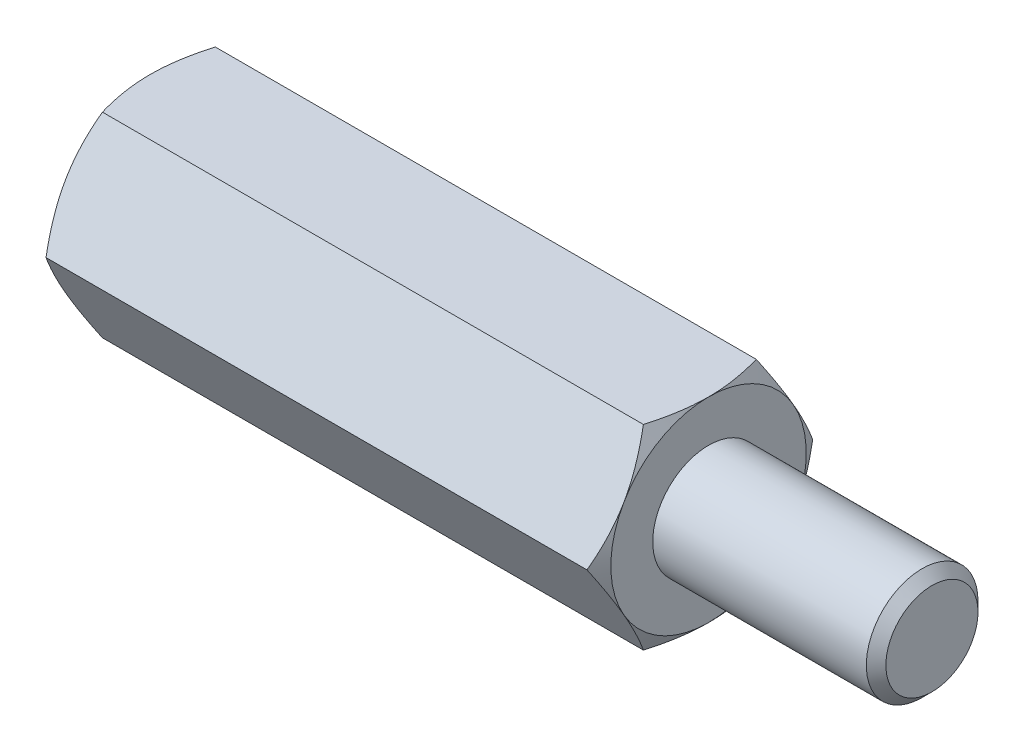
ISO-10303-21;
HEADER;
FILE_DESCRIPTION(('STEP AP214'),'2;1');
FILE_NAME('part.step','',(''),(''),'','','');
FILE_SCHEMA(('AUTOMOTIVE_DESIGN { 1 0 10303 214 1 1 1 1 }'));
ENDSEC;
DATA;
#1=APPLICATION_CONTEXT('core data for automotive mechanical design processes');
#2=APPLICATION_PROTOCOL_DEFINITION('international standard','automotive_design',2000,#1);
#3=PRODUCT_CONTEXT('',#1,'mechanical');
#4=PRODUCT('Part','Part','',(#3));
#5=PRODUCT_RELATED_PRODUCT_CATEGORY('part','',(#4));
#6=PRODUCT_DEFINITION_FORMATION('','',#4);
#7=PRODUCT_DEFINITION_CONTEXT('part definition',#1,'design');
#8=PRODUCT_DEFINITION('design','',#6,#7);
#9=PRODUCT_DEFINITION_SHAPE('','',#8);
#10=(LENGTH_UNIT() NAMED_UNIT(*) SI_UNIT(.MILLI.,.METRE.));
#11=(NAMED_UNIT(*) PLANE_ANGLE_UNIT() SI_UNIT($,.RADIAN.));
#12=(NAMED_UNIT(*) SI_UNIT($,.STERADIAN.) SOLID_ANGLE_UNIT());
#13=UNCERTAINTY_MEASURE_WITH_UNIT(LENGTH_MEASURE(1.E-05),#10,'distance_accuracy_value','');
#14=(GEOMETRIC_REPRESENTATION_CONTEXT(3) GLOBAL_UNCERTAINTY_ASSIGNED_CONTEXT((#13)) GLOBAL_UNIT_ASSIGNED_CONTEXT((#10,
#11,#12)) REPRESENTATION_CONTEXT('',''));
#15=CARTESIAN_POINT('',(0.,0.,0.));
#16=DIRECTION('',(0.,0.,1.));
#17=DIRECTION('',(1.,0.,0.));
#18=AXIS2_PLACEMENT_3D('',#15,#16,#17);
#19=CARTESIAN_POINT('',(10.,3.5,-2.02072594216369));
#20=DIRECTION('',(1.,0.,0.));
#21=DIRECTION('',(0.,0.,-1.));
#22=AXIS2_PLACEMENT_3D('',#19,#20,#21);
#23=PLANE('',#22);
#24=CARTESIAN_POINT('',(10.,0.,0.));
#25=DIRECTION('',(1.,0.,0.));
#26=DIRECTION('',(0.,0.,-1.));
#27=AXIS2_PLACEMENT_3D('',#24,#25,#26);
#28=CIRCLE('',#27,3.5);
#29=CARTESIAN_POINT('',(10.,-1.75,-3.03108891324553));
#30=VERTEX_POINT('',#29);
#31=CARTESIAN_POINT('',(10.,1.75,-3.03108891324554));
#32=VERTEX_POINT('',#31);
#33=EDGE_CURVE('E288',#30,#32,#28,.T.);
#34=ORIENTED_EDGE('',*,*,#33,.T.);
#35=CARTESIAN_POINT('',(10.,3.5,0.));
#36=VERTEX_POINT('',#35);
#37=EDGE_CURVE('E53',#32,#36,#28,.T.);
#38=ORIENTED_EDGE('',*,*,#37,.T.);
#39=CARTESIAN_POINT('',(10.,1.75,3.03108891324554));
#40=VERTEX_POINT('',#39);
#41=EDGE_CURVE('E297',#36,#40,#28,.T.);
#42=ORIENTED_EDGE('',*,*,#41,.T.);
#43=CARTESIAN_POINT('',(10.,-1.75,3.03108891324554));
#44=VERTEX_POINT('',#43);
#45=EDGE_CURVE('E302',#40,#44,#28,.T.);
#46=ORIENTED_EDGE('',*,*,#45,.T.);
#47=CARTESIAN_POINT('',(10.,0.,0.));
#48=DIRECTION('',(-1.,0.,0.));
#49=DIRECTION('',(0.,-1.,0.));
#50=AXIS2_PLACEMENT_3D('',#47,#48,#49);
#51=CIRCLE('',#50,3.5);
#52=CARTESIAN_POINT('',(10.,-3.5,0.));
#53=VERTEX_POINT('',#52);
#54=EDGE_CURVE('E193',#53,#44,#51,.T.);
#55=ORIENTED_EDGE('',*,*,#54,.F.);
#56=EDGE_CURVE('E61',#53,#30,#28,.T.);
#57=ORIENTED_EDGE('',*,*,#56,.T.);
#58=EDGE_LOOP('',(#34,#38,#42,#46,#55,#57));
#59=FACE_BOUND('',#58,.T.);
#60=CARTESIAN_POINT('',(10.,0.,0.));
#61=DIRECTION('',(1.,0.,0.));
#62=DIRECTION('',(0.,0.,-1.));
#63=AXIS2_PLACEMENT_3D('',#60,#61,#62);
#64=CIRCLE('',#63,2.);
#65=CARTESIAN_POINT('',(10.,0.,-2.));
#66=VERTEX_POINT('',#65);
#67=EDGE_CURVE('E347',#66,#66,#64,.T.);
#68=ORIENTED_EDGE('',*,*,#67,.F.);
#69=EDGE_LOOP('',(#68));
#70=FACE_BOUND('',#69,.T.);
#71=ADVANCED_FACE('F37',(#59,#70),#23,.T.);
#72=CARTESIAN_POINT('',(10.,0.,-4.04145188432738));
#73=DIRECTION('',(0.,-0.5,0.866025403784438));
#74=DIRECTION('',(0.,-0.866025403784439,-0.5));
#75=AXIS2_PLACEMENT_3D('',#72,#73,#74);
#76=PLANE('',#75);
#77=CARTESIAN_POINT('',(9.68732593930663,-0.000200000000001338,-4.04156735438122));
#78=CARTESIAN_POINT('',(9.73861421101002,0.153607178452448,-3.9527667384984));
#79=CARTESIAN_POINT('',(9.78525904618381,0.308742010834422,-3.86319960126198));
#80=CARTESIAN_POINT('',(9.86667812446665,0.621698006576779,-3.68251437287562));
#81=CARTESIAN_POINT('',(9.90142356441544,0.779524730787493,-3.59139307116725));
#82=CARTESIAN_POINT('',(9.95550997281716,1.09322221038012,-3.41027974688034));
#83=CARTESIAN_POINT('',(9.97521091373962,1.24904469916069,-3.32031559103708));
#84=CARTESIAN_POINT('',(9.99872986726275,1.56142288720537,-3.13996396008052));
#85=CARTESIAN_POINT('',(10.0025673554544,1.71797745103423,-3.04957714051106));
#86=CARTESIAN_POINT('',(9.99458469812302,2.01050921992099,-2.88068384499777));
#87=CARTESIAN_POINT('',(9.9847245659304,2.1465302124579,-2.80215208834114));
#88=CARTESIAN_POINT('',(9.9534735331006,2.41768602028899,-2.64560020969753));
#89=CARTESIAN_POINT('',(9.93207195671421,2.55281989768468,-2.5675806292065));
#90=CARTESIAN_POINT('',(9.87856959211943,2.82453479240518,-2.41070596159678));
#91=CARTESIAN_POINT('',(9.84624200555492,2.96108141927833,-2.33187072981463));
#92=CARTESIAN_POINT('',(9.77287106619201,3.2321380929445,-2.17537608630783));
#93=CARTESIAN_POINT('',(9.73184495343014,3.36665161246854,-2.09771466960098));
#94=CARTESIAN_POINT('',(9.68732593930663,3.5002,-2.02061047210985));
#95=B_SPLINE_CURVE_WITH_KNOTS('',3,(#77,#78,#79,#80,#81,#82,#83,#84,#85,#86,#87,#88,#89,#90,#91,
#92,#93,#94),.UNSPECIFIED.,.F.,.F.,(4,2,2,2,2,2,2,2,4),(0.,0.554793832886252,1.11092123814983,
1.65328467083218,2.19498204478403,2.6666513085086,3.13875761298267,3.6213361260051,
4.10296698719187),.UNSPECIFIED.);
#96=CARTESIAN_POINT('',(9.68739260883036,0.,-4.04145188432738));
#97=VERTEX_POINT('',#96);
#98=EDGE_CURVE('E316',#97,#32,#95,.T.);
#99=ORIENTED_EDGE('',*,*,#98,.F.);
#100=DIRECTION('',(-1.,0.,0.));
#101=VECTOR('',#100,1.);
#102=CARTESIAN_POINT('',(10.,0.,-4.04145188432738));
#103=LINE('',#102,#101);
#104=CARTESIAN_POINT('',(-9.68739260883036,0.,-4.04145188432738));
#105=VERTEX_POINT('',#104);
#106=EDGE_CURVE('E264',#97,#105,#103,.T.);
#107=ORIENTED_EDGE('',*,*,#106,.T.);
#108=CARTESIAN_POINT('',(-9.68732593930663,3.5002,-2.02061047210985));
#109=CARTESIAN_POINT('',(-9.73861421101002,3.34639282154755,-2.10941108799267));
#110=CARTESIAN_POINT('',(-9.78525904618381,3.19125798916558,-2.19897822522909));
#111=CARTESIAN_POINT('',(-9.86667812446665,2.87830199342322,-2.37966345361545));
#112=CARTESIAN_POINT('',(-9.90142356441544,2.72047526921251,-2.47078475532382));
#113=CARTESIAN_POINT('',(-9.95550997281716,2.40677778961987,-2.65189807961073));
#114=CARTESIAN_POINT('',(-9.97521091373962,2.25095530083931,-2.74186223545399));
#115=CARTESIAN_POINT('',(-9.99872986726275,1.93857711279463,-2.92221386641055));
#116=CARTESIAN_POINT('',(-10.0025673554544,1.78202254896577,-3.01260068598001));
#117=CARTESIAN_POINT('',(-9.99458469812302,1.48949078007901,-3.1814939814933));
#118=CARTESIAN_POINT('',(-9.9847245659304,1.3534697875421,-3.26002573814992));
#119=CARTESIAN_POINT('',(-9.9534735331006,1.08231397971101,-3.41657761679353));
#120=CARTESIAN_POINT('',(-9.93207195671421,0.947180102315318,-3.49459719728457));
#121=CARTESIAN_POINT('',(-9.87856959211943,0.675465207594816,-3.65147186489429));
#122=CARTESIAN_POINT('',(-9.84624200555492,0.538918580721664,-3.73030709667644));
#123=CARTESIAN_POINT('',(-9.77287106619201,0.267861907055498,-3.88680174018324));
#124=CARTESIAN_POINT('',(-9.73184495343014,0.133348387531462,-3.96446315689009));
#125=CARTESIAN_POINT('',(-9.68732593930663,-0.000200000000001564,-4.04156735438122));
#126=B_SPLINE_CURVE_WITH_KNOTS('',3,(#108,#109,#110,#111,#112,#113,#114,#115,#116,#117,#118,
#119,#120,#121,#122,#123,#124,#125),.UNSPECIFIED.,.F.,.F.,(4,2,2,2,2,2,2,2,4),(0.,
0.554793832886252,1.11092123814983,1.65328467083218,2.19498204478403,2.6666513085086,
3.13875761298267,3.6213361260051,4.10296698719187),.UNSPECIFIED.);
#127=CARTESIAN_POINT('',(-10.,1.75,-3.03108891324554));
#128=VERTEX_POINT('',#127);
#129=EDGE_CURVE('E323',#128,#105,#126,.T.);
#130=ORIENTED_EDGE('',*,*,#129,.F.);
#131=CARTESIAN_POINT('',(-9.68739260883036,3.5,-2.02072594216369));
#132=VERTEX_POINT('',#131);
#133=EDGE_CURVE('E326',#132,#128,#126,.T.);
#134=ORIENTED_EDGE('',*,*,#133,.F.);
#135=DIRECTION('',(-1.,0.,0.));
#136=VECTOR('',#135,1.);
#137=CARTESIAN_POINT('',(10.,3.5,-2.02072594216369));
#138=LINE('',#137,#136);
#139=CARTESIAN_POINT('',(9.68739260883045,3.5,-2.02072594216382));
#140=VERTEX_POINT('',#139);
#141=EDGE_CURVE('E279',#140,#132,#138,.T.);
#142=ORIENTED_EDGE('',*,*,#141,.F.);
#143=EDGE_CURVE('E229',#32,#140,#95,.T.);
#144=ORIENTED_EDGE('',*,*,#143,.F.);
#145=EDGE_LOOP('',(#99,#107,#130,#134,#142,#144));
#146=FACE_BOUND('',#145,.T.);
#147=ADVANCED_FACE('F148',(#146),#76,.F.);
#148=CARTESIAN_POINT('',(10.,3.5,-2.02072594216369));
#149=DIRECTION('',(0.,-1.,0.));
#150=DIRECTION('',(0.,0.,-1.));
#151=AXIS2_PLACEMENT_3D('',#148,#149,#150);
#152=PLANE('',#151);
#153=CARTESIAN_POINT('',(8.24432944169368,3.5,-5.525713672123));
#154=CARTESIAN_POINT('',(8.3192813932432,3.5,-5.37200190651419));
#155=CARTESIAN_POINT('',(8.39354243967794,3.5,-5.21794762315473));
#156=CARTESIAN_POINT('',(8.54029601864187,3.5,-4.90897223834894));
#157=CARTESIAN_POINT('',(8.61278829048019,3.5,-4.75405101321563));
#158=CARTESIAN_POINT('',(8.75596172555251,3.5,-4.44240758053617));
#159=CARTESIAN_POINT('',(8.82663168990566,3.5,-4.28568021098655));
#160=CARTESIAN_POINT('',(8.96520746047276,3.5,-3.97101270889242));
#161=CARTESIAN_POINT('',(9.03311339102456,3.5,-3.81307263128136));
#162=CARTESIAN_POINT('',(9.16771439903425,3.5,-3.49026114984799));
#163=CARTESIAN_POINT('',(9.23428710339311,3.5,-3.32533845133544));
#164=CARTESIAN_POINT('',(9.36262677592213,3.5,-2.99359992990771));
#165=CARTESIAN_POINT('',(9.42439321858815,3.5,-2.82678390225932));
#166=CARTESIAN_POINT('',(9.54157006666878,3.5,-2.49127529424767));
#167=CARTESIAN_POINT('',(9.59699254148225,3.5,-2.32258697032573));
#168=CARTESIAN_POINT('',(9.69976794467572,3.5,-1.98279215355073));
#169=CARTESIAN_POINT('',(9.74712331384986,3.5,-1.81168640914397));
#170=CARTESIAN_POINT('',(9.83129873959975,3.5,-1.46793354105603));
#171=CARTESIAN_POINT('',(9.86817965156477,3.5,-1.2953015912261));
#172=CARTESIAN_POINT('',(9.92939557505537,3.5,-0.947791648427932));
#173=CARTESIAN_POINT('',(9.95373192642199,3.5,-0.772913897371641));
#174=CARTESIAN_POINT('',(9.98760388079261,3.5,-0.424108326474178));
#175=CARTESIAN_POINT('',(9.99733725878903,3.5,-0.250200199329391));
#176=CARTESIAN_POINT('',(10.0017053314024,3.5,0.0978233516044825));
#177=CARTESIAN_POINT('',(9.99633996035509,3.5,0.271938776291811));
#178=CARTESIAN_POINT('',(9.97501181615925,3.5,0.564711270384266));
#179=CARTESIAN_POINT('',(9.96289198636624,3.5,0.683667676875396));
#180=CARTESIAN_POINT('',(9.93230809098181,3.5,0.920767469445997));
#181=CARTESIAN_POINT('',(9.91384324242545,3.5,1.03891075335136));
#182=CARTESIAN_POINT('',(9.84989562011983,3.5,1.39193174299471));
#183=CARTESIAN_POINT('',(9.79586958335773,3.5,1.62528232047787));
#184=CARTESIAN_POINT('',(9.70145152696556,3.5,1.97433825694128));
#185=CARTESIAN_POINT('',(9.66729009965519,3.5,2.09183268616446));
#186=CARTESIAN_POINT('',(9.59523444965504,3.5,2.32568238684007));
#187=CARTESIAN_POINT('',(9.55734019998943,3.5,2.44203765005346));
#188=CARTESIAN_POINT('',(9.47844216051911,3.5,2.67364238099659));
#189=CARTESIAN_POINT('',(9.43743925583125,3.5,2.78889215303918));
#190=CARTESIAN_POINT('',(9.35282457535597,3.5,3.01842460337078));
#191=CARTESIAN_POINT('',(9.3092128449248,3.5,3.13270729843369));
#192=CARTESIAN_POINT('',(9.19582414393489,3.5,3.42150510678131));
#193=CARTESIAN_POINT('',(9.12456360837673,3.5,3.59543696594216));
#194=CARTESIAN_POINT('',(8.97810267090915,3.5,3.94163961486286));
#195=CARTESIAN_POINT('',(8.90290192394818,3.5,4.11391025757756));
#196=CARTESIAN_POINT('',(8.74942525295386,3.5,4.45713072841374));
#197=CARTESIAN_POINT('',(8.67114846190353,3.5,4.62808016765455));
#198=CARTESIAN_POINT('',(8.51218826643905,3.5,4.9688584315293));
#199=CARTESIAN_POINT('',(8.43150479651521,3.5,5.13868722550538));
#200=CARTESIAN_POINT('',(8.18638713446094,3.5,5.64726192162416));
#201=CARTESIAN_POINT('',(8.0190975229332,3.5,5.98463020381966));
#202=CARTESIAN_POINT('',(7.67958549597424,3.5,6.65678495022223));
#203=CARTESIAN_POINT('',(7.5073639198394,3.5,6.99157184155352));
#204=CARTESIAN_POINT('',(7.17608002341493,3.5,7.62749570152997));
#205=CARTESIAN_POINT('',(7.01732992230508,3.5,7.92879562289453));
#206=CARTESIAN_POINT('',(6.69774734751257,3.5,8.53030635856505));
#207=CARTESIAN_POINT('',(6.53691477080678,3.5,8.83051711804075));
#208=CARTESIAN_POINT('',(6.21417926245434,3.5,9.42918006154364));
#209=CARTESIAN_POINT('',(6.0522810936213,3.5,9.72763481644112));
#210=CARTESIAN_POINT('',(5.7272737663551,3.5,10.3238577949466));
#211=CARTESIAN_POINT('',(5.56416469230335,3.5,10.6216260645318));
#212=CARTESIAN_POINT('',(5.40061041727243,3.5,10.9191478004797));
#213=B_SPLINE_CURVE_WITH_KNOTS('',3,(#153,#154,#155,#156,#157,#158,#159,#160,#161,#162,#163,
#164,#165,#166,#167,#168,#169,#170,#171,#172,#173,#174,#175,#176,#177,#178,#179,#180,#181,#182,
#183,#184,#185,#186,#187,#188,#189,#190,#191,#192,#193,#194,#195,#196,#197,#198,#199,#200,#201,
#202,#203,#204,#205,#206,#207,#208,#209,#210,#211,#212),.UNSPECIFIED.,.F.,.F.,(4,2,2,2,2,2,2,2,
2,2,2,2,2,2,2,2,2,2,2,2,2,2,2,2,2,2,2,2,2,4),(0.,0.513041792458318,1.02615874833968,
1.54190801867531,2.05763406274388,2.59113284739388,3.1246898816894,3.65721433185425,
4.18957737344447,4.71878103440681,5.24792816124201,5.76984197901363,6.29175806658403,
6.65030258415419,7.0088913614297,7.72642330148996,8.09346920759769,8.46051776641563,
8.8274622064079,9.19440026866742,9.75822236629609,10.3220939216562,10.8861255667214,
11.4501725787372,12.579801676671,13.7092396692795,14.730918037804,15.7526471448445,
16.771258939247,17.7898004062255),.UNSPECIFIED.);
#214=EDGE_CURVE('E227',#140,#36,#213,.T.);
#215=ORIENTED_EDGE('',*,*,#214,.F.);
#216=ORIENTED_EDGE('',*,*,#141,.T.);
#217=CARTESIAN_POINT('',(-8.24432944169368,3.5,-5.52571367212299));
#218=CARTESIAN_POINT('',(-8.3192813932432,3.5,-5.37200190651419));
#219=CARTESIAN_POINT('',(-8.39354243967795,3.5,-5.21794762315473));
#220=CARTESIAN_POINT('',(-8.54029601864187,3.5,-4.90897223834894));
#221=CARTESIAN_POINT('',(-8.61278829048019,3.5,-4.75405101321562));
#222=CARTESIAN_POINT('',(-8.75596172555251,3.5,-4.44240758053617));
#223=CARTESIAN_POINT('',(-8.82663168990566,3.5,-4.28568021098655));
#224=CARTESIAN_POINT('',(-8.96520746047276,3.5,-3.97101270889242));
#225=CARTESIAN_POINT('',(-9.03311339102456,3.5,-3.81307263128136));
#226=CARTESIAN_POINT('',(-9.16771439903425,3.5,-3.49026114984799));
#227=CARTESIAN_POINT('',(-9.23428710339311,3.5,-3.32533845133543));
#228=CARTESIAN_POINT('',(-9.36262677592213,3.5,-2.99359992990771));
#229=CARTESIAN_POINT('',(-9.42439321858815,3.5,-2.82678390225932));
#230=CARTESIAN_POINT('',(-9.54157006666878,3.5,-2.49127529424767));
#231=CARTESIAN_POINT('',(-9.59699254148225,3.5,-2.32258697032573));
#232=CARTESIAN_POINT('',(-9.69976794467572,3.5,-1.98279215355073));
#233=CARTESIAN_POINT('',(-9.74712331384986,3.5,-1.81168640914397));
#234=CARTESIAN_POINT('',(-9.83129873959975,3.5,-1.46793354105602));
#235=CARTESIAN_POINT('',(-9.86817965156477,3.5,-1.2953015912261));
#236=CARTESIAN_POINT('',(-9.92939557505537,3.5,-0.94779164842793));
#237=CARTESIAN_POINT('',(-9.953731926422,3.5,-0.772913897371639));
#238=CARTESIAN_POINT('',(-9.98760388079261,3.5,-0.424108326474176));
#239=CARTESIAN_POINT('',(-9.99733725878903,3.5,-0.250200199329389));
#240=CARTESIAN_POINT('',(-10.0017053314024,3.5,0.0978233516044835));
#241=CARTESIAN_POINT('',(-9.99633996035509,3.5,0.271938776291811));
#242=CARTESIAN_POINT('',(-9.97501181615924,3.5,0.564711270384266));
#243=CARTESIAN_POINT('',(-9.96289198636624,3.5,0.683667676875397));
#244=CARTESIAN_POINT('',(-9.93230809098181,3.5,0.920767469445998));
#245=CARTESIAN_POINT('',(-9.91384324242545,3.5,1.03891075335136));
#246=CARTESIAN_POINT('',(-9.84989562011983,3.5,1.39193174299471));
#247=CARTESIAN_POINT('',(-9.79586958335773,3.5,1.62528232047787));
#248=CARTESIAN_POINT('',(-9.70145152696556,3.5,1.97433825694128));
#249=CARTESIAN_POINT('',(-9.66729009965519,3.5,2.09183268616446));
#250=CARTESIAN_POINT('',(-9.59523444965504,3.5,2.32568238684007));
#251=CARTESIAN_POINT('',(-9.55734019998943,3.5,2.44203765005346));
#252=CARTESIAN_POINT('',(-9.47844216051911,3.5,2.67364238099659));
#253=CARTESIAN_POINT('',(-9.43743925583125,3.5,2.78889215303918));
#254=CARTESIAN_POINT('',(-9.35282457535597,3.5,3.01842460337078));
#255=CARTESIAN_POINT('',(-9.3092128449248,3.5,3.13270729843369));
#256=CARTESIAN_POINT('',(-9.19582414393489,3.5,3.42150510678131));
#257=CARTESIAN_POINT('',(-9.12456360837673,3.5,3.59543696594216));
#258=CARTESIAN_POINT('',(-8.97810267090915,3.5,3.94163961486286));
#259=CARTESIAN_POINT('',(-8.90290192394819,3.5,4.11391025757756));
#260=CARTESIAN_POINT('',(-8.74942525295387,3.5,4.45713072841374));
#261=CARTESIAN_POINT('',(-8.67114846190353,3.5,4.62808016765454));
#262=CARTESIAN_POINT('',(-8.51218826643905,3.5,4.96885843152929));
#263=CARTESIAN_POINT('',(-8.43150479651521,3.5,5.13868722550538));
#264=CARTESIAN_POINT('',(-8.18638713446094,3.5,5.64726192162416));
#265=CARTESIAN_POINT('',(-8.01909752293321,3.5,5.98463020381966));
#266=CARTESIAN_POINT('',(-7.67958549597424,3.5,6.65678495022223));
#267=CARTESIAN_POINT('',(-7.5073639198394,3.5,6.99157184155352));
#268=CARTESIAN_POINT('',(-7.17608002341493,3.5,7.62749570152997));
#269=CARTESIAN_POINT('',(-7.01732992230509,3.5,7.92879562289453));
#270=CARTESIAN_POINT('',(-6.69774734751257,3.5,8.53030635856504));
#271=CARTESIAN_POINT('',(-6.53691477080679,3.5,8.83051711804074));
#272=CARTESIAN_POINT('',(-6.21417926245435,3.5,9.42918006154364));
#273=CARTESIAN_POINT('',(-6.0522810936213,3.5,9.72763481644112));
#274=CARTESIAN_POINT('',(-5.7272737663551,3.5,10.3238577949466));
#275=CARTESIAN_POINT('',(-5.56416469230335,3.5,10.6216260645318));
#276=CARTESIAN_POINT('',(-5.40061041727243,3.5,10.9191478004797));
#277=B_SPLINE_CURVE_WITH_KNOTS('',3,(#217,#218,#219,#220,#221,#222,#223,#224,#225,#226,#227,
#228,#229,#230,#231,#232,#233,#234,#235,#236,#237,#238,#239,#240,#241,#242,#243,#244,#245,#246,
#247,#248,#249,#250,#251,#252,#253,#254,#255,#256,#257,#258,#259,#260,#261,#262,#263,#264,#265,
#266,#267,#268,#269,#270,#271,#272,#273,#274,#275,#276),.UNSPECIFIED.,.F.,.F.,(4,2,2,2,2,2,2,2,
2,2,2,2,2,2,2,2,2,2,2,2,2,2,2,2,2,2,2,2,2,4),(0.,0.513041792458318,1.02615874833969,
1.54190801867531,2.05763406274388,2.59113284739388,3.1246898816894,3.65721433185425,
4.18957737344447,4.71878103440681,5.24792816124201,5.76984197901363,6.29175806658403,
6.65030258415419,7.0088913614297,7.72642330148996,8.09346920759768,8.46051776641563,
8.8274622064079,9.19440026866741,9.75822236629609,10.3220939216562,10.8861255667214,
11.4501725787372,12.579801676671,13.7092396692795,14.730918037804,15.7526471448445,
16.7712589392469,17.7898004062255),.UNSPECIFIED.);
#278=CARTESIAN_POINT('',(-10.,3.5,0.));
#279=VERTEX_POINT('',#278);
#280=EDGE_CURVE('E241',#279,#132,#277,.F.);
#281=ORIENTED_EDGE('',*,*,#280,.F.);
#282=CARTESIAN_POINT('',(-9.68739260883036,3.5,2.02072594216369));
#283=VERTEX_POINT('',#282);
#284=EDGE_CURVE('E249',#283,#279,#277,.F.);
#285=ORIENTED_EDGE('',*,*,#284,.F.);
#286=DIRECTION('',(-1.,0.,0.));
#287=VECTOR('',#286,1.);
#288=CARTESIAN_POINT('',(10.,3.5,2.02072594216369));
#289=LINE('',#288,#287);
#290=CARTESIAN_POINT('',(9.68739260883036,3.5,2.02072594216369));
#291=VERTEX_POINT('',#290);
#292=EDGE_CURVE('E276',#291,#283,#289,.T.);
#293=ORIENTED_EDGE('',*,*,#292,.F.);
#294=EDGE_CURVE('E221',#36,#291,#213,.T.);
#295=ORIENTED_EDGE('',*,*,#294,.F.);
#296=EDGE_LOOP('',(#215,#216,#281,#285,#293,#295));
#297=FACE_BOUND('',#296,.T.);
#298=ADVANCED_FACE('F153',(#297),#152,.F.);
#299=CARTESIAN_POINT('',(10.,3.5,2.02072594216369));
#300=DIRECTION('',(0.,-0.5,-0.866025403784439));
#301=DIRECTION('',(0.,0.866025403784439,-0.5));
#302=AXIS2_PLACEMENT_3D('',#299,#300,#301);
#303=PLANE('',#302);
#304=CARTESIAN_POINT('',(9.68732593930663,3.5002,2.02061047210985));
#305=CARTESIAN_POINT('',(9.73861421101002,3.34639282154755,2.10941108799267));
#306=CARTESIAN_POINT('',(9.78525904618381,3.19125798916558,2.19897822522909));
#307=CARTESIAN_POINT('',(9.86667812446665,2.87830199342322,2.37966345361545));
#308=CARTESIAN_POINT('',(9.90142356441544,2.7204752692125,2.47078475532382));
#309=CARTESIAN_POINT('',(9.95550997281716,2.40677778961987,2.65189807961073));
#310=CARTESIAN_POINT('',(9.97521091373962,2.25095530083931,2.74186223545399));
#311=CARTESIAN_POINT('',(9.99872986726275,1.93857711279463,2.92221386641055));
#312=CARTESIAN_POINT('',(10.0025673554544,1.78202254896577,3.01260068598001));
#313=CARTESIAN_POINT('',(9.99458469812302,1.48949078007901,3.1814939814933));
#314=CARTESIAN_POINT('',(9.98472456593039,1.35346978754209,3.26002573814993));
#315=CARTESIAN_POINT('',(9.9534735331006,1.08231397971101,3.41657761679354));
#316=CARTESIAN_POINT('',(9.9320719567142,0.947180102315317,3.49459719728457));
#317=CARTESIAN_POINT('',(9.87856959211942,0.675465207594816,3.65147186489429));
#318=CARTESIAN_POINT('',(9.84624200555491,0.538918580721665,3.73030709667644));
#319=CARTESIAN_POINT('',(9.77287106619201,0.267861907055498,3.88680174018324));
#320=CARTESIAN_POINT('',(9.73184495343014,0.133348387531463,3.96446315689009));
#321=CARTESIAN_POINT('',(9.68732593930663,-0.000200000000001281,4.04156735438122));
#322=B_SPLINE_CURVE_WITH_KNOTS('',3,(#304,#305,#306,#307,#308,#309,#310,#311,#312,#313,#314,
#315,#316,#317,#318,#319,#320,#321),.UNSPECIFIED.,.F.,.F.,(4,2,2,2,2,2,2,2,4),(0.,
0.554793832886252,1.11092123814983,1.65328467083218,2.19498204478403,2.6666513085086,
3.13875761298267,3.62133612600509,4.10296698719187),.UNSPECIFIED.);
#323=EDGE_CURVE('E228',#291,#40,#322,.T.);
#324=ORIENTED_EDGE('',*,*,#323,.F.);
#325=ORIENTED_EDGE('',*,*,#292,.T.);
#326=CARTESIAN_POINT('',(-9.68732593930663,-0.000200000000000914,4.04156735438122));
#327=CARTESIAN_POINT('',(-9.73861421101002,0.153607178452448,3.9527667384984));
#328=CARTESIAN_POINT('',(-9.78525904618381,0.308742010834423,3.86319960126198));
#329=CARTESIAN_POINT('',(-9.86667812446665,0.62169800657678,3.68251437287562));
#330=CARTESIAN_POINT('',(-9.90142356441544,0.779524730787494,3.59139307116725));
#331=CARTESIAN_POINT('',(-9.95550997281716,1.09322221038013,3.41027974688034));
#332=CARTESIAN_POINT('',(-9.97521091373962,1.24904469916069,3.32031559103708));
#333=CARTESIAN_POINT('',(-9.99872986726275,1.56142288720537,3.13996396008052));
#334=CARTESIAN_POINT('',(-10.0025673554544,1.71797745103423,3.04957714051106));
#335=CARTESIAN_POINT('',(-9.99458469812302,2.01050921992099,2.88068384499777));
#336=CARTESIAN_POINT('',(-9.98472456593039,2.1465302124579,2.80215208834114));
#337=CARTESIAN_POINT('',(-9.9534735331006,2.41768602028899,2.64560020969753));
#338=CARTESIAN_POINT('',(-9.9320719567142,2.55281989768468,2.5675806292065));
#339=CARTESIAN_POINT('',(-9.87856959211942,2.82453479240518,2.41070596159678));
#340=CARTESIAN_POINT('',(-9.84624200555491,2.96108141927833,2.33187072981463));
#341=CARTESIAN_POINT('',(-9.77287106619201,3.2321380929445,2.17537608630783));
#342=CARTESIAN_POINT('',(-9.73184495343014,3.36665161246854,2.09771466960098));
#343=CARTESIAN_POINT('',(-9.68732593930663,3.5002,2.02061047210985));
#344=B_SPLINE_CURVE_WITH_KNOTS('',3,(#326,#327,#328,#329,#330,#331,#332,#333,#334,#335,#336,
#337,#338,#339,#340,#341,#342,#343),.UNSPECIFIED.,.F.,.F.,(4,2,2,2,2,2,2,2,4),(0.,
0.554793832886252,1.11092123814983,1.65328467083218,2.19498204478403,2.6666513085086,
3.13875761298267,3.62133612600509,4.10296698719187),.UNSPECIFIED.);
#345=CARTESIAN_POINT('',(-10.,1.75,3.03108891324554));
#346=VERTEX_POINT('',#345);
#347=EDGE_CURVE('E255',#346,#283,#344,.T.);
#348=ORIENTED_EDGE('',*,*,#347,.F.);
#349=CARTESIAN_POINT('',(-9.68739260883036,0.,4.04145188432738));
#350=VERTEX_POINT('',#349);
#351=EDGE_CURVE('E262',#350,#346,#344,.T.);
#352=ORIENTED_EDGE('',*,*,#351,.F.);
#353=DIRECTION('',(-1.,0.,0.));
#354=VECTOR('',#353,1.);
#355=CARTESIAN_POINT('',(10.,0.,4.04145188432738));
#356=LINE('',#355,#354);
#357=CARTESIAN_POINT('',(9.68739260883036,0.,4.04145188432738));
#358=VERTEX_POINT('',#357);
#359=EDGE_CURVE('E273',#358,#350,#356,.T.);
#360=ORIENTED_EDGE('',*,*,#359,.F.);
#361=EDGE_CURVE('E215',#40,#358,#322,.T.);
#362=ORIENTED_EDGE('',*,*,#361,.F.);
#363=EDGE_LOOP('',(#324,#325,#348,#352,#360,#362));
#364=FACE_BOUND('',#363,.T.);
#365=ADVANCED_FACE('F235',(#364),#303,.F.);
#366=CARTESIAN_POINT('',(10.,0.,4.04145188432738));
#367=DIRECTION('',(0.,0.5,-0.866025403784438));
#368=DIRECTION('',(0.,0.866025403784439,0.5));
#369=AXIS2_PLACEMENT_3D('',#366,#367,#368);
#370=PLANE('',#369);
#371=CARTESIAN_POINT('',(9.68732593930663,0.000199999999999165,4.04156735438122));
#372=CARTESIAN_POINT('',(9.73861421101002,-0.15360717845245,3.9527667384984));
#373=CARTESIAN_POINT('',(9.78525904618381,-0.308742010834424,3.86319960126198));
#374=CARTESIAN_POINT('',(9.86667812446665,-0.621698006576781,3.68251437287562));
#375=CARTESIAN_POINT('',(9.90142356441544,-0.779524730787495,3.59139307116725));
#376=CARTESIAN_POINT('',(9.95550997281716,-1.09322221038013,3.41027974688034));
#377=CARTESIAN_POINT('',(9.97521091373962,-1.24904469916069,3.32031559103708));
#378=CARTESIAN_POINT('',(9.99872986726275,-1.56142288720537,3.13996396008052));
#379=CARTESIAN_POINT('',(10.0025673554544,-1.71797745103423,3.04957714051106));
#380=CARTESIAN_POINT('',(9.99458469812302,-2.01050921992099,2.88068384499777));
#381=CARTESIAN_POINT('',(9.9847245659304,-2.1465302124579,2.80215208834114));
#382=CARTESIAN_POINT('',(9.9534735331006,-2.41768602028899,2.64560020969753));
#383=CARTESIAN_POINT('',(9.93207195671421,-2.55281989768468,2.5675806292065));
#384=CARTESIAN_POINT('',(9.87856959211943,-2.82453479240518,2.41070596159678));
#385=CARTESIAN_POINT('',(9.84624200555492,-2.96108141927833,2.33187072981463));
#386=CARTESIAN_POINT('',(9.77287106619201,-3.2321380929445,2.17537608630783));
#387=CARTESIAN_POINT('',(9.73184495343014,-3.36665161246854,2.09771466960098));
#388=CARTESIAN_POINT('',(9.68732593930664,-3.5002,2.02061047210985));
#389=B_SPLINE_CURVE_WITH_KNOTS('',3,(#371,#372,#373,#374,#375,#376,#377,#378,#379,#380,#381,
#382,#383,#384,#385,#386,#387,#388),.UNSPECIFIED.,.F.,.F.,(4,2,2,2,2,2,2,2,4),(0.,
0.554793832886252,1.11092123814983,1.65328467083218,2.19498204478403,2.6666513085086,
3.13875761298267,3.62133612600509,4.10296698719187),.UNSPECIFIED.);
#390=EDGE_CURVE('E339',#358,#44,#389,.T.);
#391=ORIENTED_EDGE('',*,*,#390,.F.);
#392=ORIENTED_EDGE('',*,*,#359,.T.);
#393=CARTESIAN_POINT('',(-9.68732593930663,-3.5002,2.02061047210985));
#394=CARTESIAN_POINT('',(-9.73861421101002,-3.34639282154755,2.10941108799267));
#395=CARTESIAN_POINT('',(-9.78525904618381,-3.19125798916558,2.19897822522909));
#396=CARTESIAN_POINT('',(-9.86667812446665,-2.87830199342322,2.37966345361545));
#397=CARTESIAN_POINT('',(-9.90142356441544,-2.72047526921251,2.47078475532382));
#398=CARTESIAN_POINT('',(-9.95550997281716,-2.40677778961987,2.65189807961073));
#399=CARTESIAN_POINT('',(-9.97521091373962,-2.25095530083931,2.74186223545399));
#400=CARTESIAN_POINT('',(-9.99872986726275,-1.93857711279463,2.92221386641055));
#401=CARTESIAN_POINT('',(-10.0025673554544,-1.78202254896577,3.01260068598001));
#402=CARTESIAN_POINT('',(-9.99458469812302,-1.48949078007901,3.1814939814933));
#403=CARTESIAN_POINT('',(-9.9847245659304,-1.3534697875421,3.26002573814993));
#404=CARTESIAN_POINT('',(-9.9534735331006,-1.08231397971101,3.41657761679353));
#405=CARTESIAN_POINT('',(-9.9320719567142,-0.947180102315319,3.49459719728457));
#406=CARTESIAN_POINT('',(-9.87856959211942,-0.675465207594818,3.65147186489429));
#407=CARTESIAN_POINT('',(-9.84624200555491,-0.538918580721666,3.73030709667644));
#408=CARTESIAN_POINT('',(-9.77287106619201,-0.2678619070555,3.88680174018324));
#409=CARTESIAN_POINT('',(-9.73184495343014,-0.133348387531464,3.96446315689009));
#410=CARTESIAN_POINT('',(-9.68732593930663,0.000199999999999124,4.04156735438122));
#411=B_SPLINE_CURVE_WITH_KNOTS('',3,(#393,#394,#395,#396,#397,#398,#399,#400,#401,#402,#403,
#404,#405,#406,#407,#408,#409,#410),.UNSPECIFIED.,.F.,.F.,(4,2,2,2,2,2,2,2,4),(0.,
0.554793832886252,1.11092123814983,1.65328467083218,2.19498204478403,2.66665130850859,
3.13875761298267,3.62133612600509,4.10296698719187),.UNSPECIFIED.);
#412=CARTESIAN_POINT('',(-10.,-1.75,3.03108891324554));
#413=VERTEX_POINT('',#412);
#414=EDGE_CURVE('E263',#413,#350,#411,.T.);
#415=ORIENTED_EDGE('',*,*,#414,.F.);
#416=CARTESIAN_POINT('',(-9.68739260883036,-3.5,2.02072594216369));
#417=VERTEX_POINT('',#416);
#418=EDGE_CURVE('E250',#417,#413,#411,.T.);
#419=ORIENTED_EDGE('',*,*,#418,.F.);
#420=DIRECTION('',(-1.,0.,0.));
#421=VECTOR('',#420,1.);
#422=CARTESIAN_POINT('',(10.,-3.5,2.02072594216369));
#423=LINE('',#422,#421);
#424=CARTESIAN_POINT('',(9.68739260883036,-3.5,2.02072594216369));
#425=VERTEX_POINT('',#424);
#426=EDGE_CURVE('E270',#425,#417,#423,.T.);
#427=ORIENTED_EDGE('',*,*,#426,.F.);
#428=EDGE_CURVE('E210',#44,#425,#389,.T.);
#429=ORIENTED_EDGE('',*,*,#428,.F.);
#430=EDGE_LOOP('',(#391,#392,#415,#419,#427,#429));
#431=FACE_BOUND('',#430,.T.);
#432=ADVANCED_FACE('F375',(#431),#370,.F.);
#433=CARTESIAN_POINT('',(10.,-3.5,2.02072594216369));
#434=DIRECTION('',(0.,1.,0.));
#435=DIRECTION('',(0.,0.,1.));
#436=AXIS2_PLACEMENT_3D('',#433,#434,#435);
#437=PLANE('',#436);
#438=CARTESIAN_POINT('',(8.24432944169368,-3.5,-5.52571367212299));
#439=CARTESIAN_POINT('',(8.3192813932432,-3.5,-5.37200190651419));
#440=CARTESIAN_POINT('',(8.39354243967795,-3.5,-5.21794762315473));
#441=CARTESIAN_POINT('',(8.54029601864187,-3.5,-4.90897223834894));
#442=CARTESIAN_POINT('',(8.61278829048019,-3.5,-4.75405101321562));
#443=CARTESIAN_POINT('',(8.75596172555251,-3.5,-4.44240758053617));
#444=CARTESIAN_POINT('',(8.82663168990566,-3.5,-4.28568021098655));
#445=CARTESIAN_POINT('',(8.96520746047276,-3.5,-3.97101270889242));
#446=CARTESIAN_POINT('',(9.03311339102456,-3.5,-3.81307263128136));
#447=CARTESIAN_POINT('',(9.16771439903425,-3.5,-3.49026114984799));
#448=CARTESIAN_POINT('',(9.23428710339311,-3.5,-3.32533845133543));
#449=CARTESIAN_POINT('',(9.36262677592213,-3.5,-2.99359992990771));
#450=CARTESIAN_POINT('',(9.42439321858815,-3.5,-2.82678390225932));
#451=CARTESIAN_POINT('',(9.54157006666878,-3.5,-2.49127529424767));
#452=CARTESIAN_POINT('',(9.59699254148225,-3.5,-2.32258697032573));
#453=CARTESIAN_POINT('',(9.69976794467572,-3.5,-1.98279215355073));
#454=CARTESIAN_POINT('',(9.74712331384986,-3.5,-1.81168640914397));
#455=CARTESIAN_POINT('',(9.83129873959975,-3.5,-1.46793354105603));
#456=CARTESIAN_POINT('',(9.86817965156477,-3.5,-1.2953015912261));
#457=CARTESIAN_POINT('',(9.92939557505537,-3.5,-0.947791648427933));
#458=CARTESIAN_POINT('',(9.953731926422,-3.5,-0.772913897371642));
#459=CARTESIAN_POINT('',(9.98760388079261,-3.5,-0.42410832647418));
#460=CARTESIAN_POINT('',(9.99733725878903,-3.5,-0.250200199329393));
#461=CARTESIAN_POINT('',(10.0017053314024,-3.5,0.0978233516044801));
#462=CARTESIAN_POINT('',(9.99633996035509,-3.5,0.271938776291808));
#463=CARTESIAN_POINT('',(9.97501181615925,-3.5,0.564711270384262));
#464=CARTESIAN_POINT('',(9.96289198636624,-3.5,0.683667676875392));
#465=CARTESIAN_POINT('',(9.93230809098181,-3.5,0.920767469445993));
#466=CARTESIAN_POINT('',(9.91384324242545,-3.5,1.03891075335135));
#467=CARTESIAN_POINT('',(9.84989562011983,-3.5,1.39193174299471));
#468=CARTESIAN_POINT('',(9.79586958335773,-3.5,1.62528232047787));
#469=CARTESIAN_POINT('',(9.70145152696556,-3.5,1.97433825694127));
#470=CARTESIAN_POINT('',(9.66729009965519,-3.5,2.09183268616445));
#471=CARTESIAN_POINT('',(9.59523444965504,-3.5,2.32568238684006));
#472=CARTESIAN_POINT('',(9.55734019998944,-3.5,2.44203765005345));
#473=CARTESIAN_POINT('',(9.47844216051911,-3.5,2.67364238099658));
#474=CARTESIAN_POINT('',(9.43743925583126,-3.5,2.78889215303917));
#475=CARTESIAN_POINT('',(9.35282457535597,-3.5,3.01842460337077));
#476=CARTESIAN_POINT('',(9.3092128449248,-3.5,3.13270729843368));
#477=CARTESIAN_POINT('',(9.1958241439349,-3.5,3.4215051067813));
#478=CARTESIAN_POINT('',(9.12456360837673,-3.5,3.59543696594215));
#479=CARTESIAN_POINT('',(8.97810267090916,-3.5,3.94163961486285));
#480=CARTESIAN_POINT('',(8.90290192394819,-3.5,4.11391025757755));
#481=CARTESIAN_POINT('',(8.74942525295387,-3.5,4.45713072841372));
#482=CARTESIAN_POINT('',(8.67114846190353,-3.5,4.62808016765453));
#483=CARTESIAN_POINT('',(8.51218826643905,-3.5,4.96885843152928));
#484=CARTESIAN_POINT('',(8.43150479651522,-3.5,5.13868722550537));
#485=CARTESIAN_POINT('',(8.18638713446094,-3.5,5.64726192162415));
#486=CARTESIAN_POINT('',(8.01909752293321,-3.5,5.98463020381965));
#487=CARTESIAN_POINT('',(7.67958549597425,-3.5,6.65678495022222));
#488=CARTESIAN_POINT('',(7.5073639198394,-3.5,6.99157184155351));
#489=CARTESIAN_POINT('',(7.17608002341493,-3.5,7.62749570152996));
#490=CARTESIAN_POINT('',(7.01732992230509,-3.5,7.92879562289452));
#491=CARTESIAN_POINT('',(6.69774734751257,-3.5,8.53030635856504));
#492=CARTESIAN_POINT('',(6.53691477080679,-3.5,8.83051711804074));
#493=CARTESIAN_POINT('',(6.21417926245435,-3.5,9.42918006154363));
#494=CARTESIAN_POINT('',(6.0522810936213,-3.5,9.72763481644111));
#495=CARTESIAN_POINT('',(5.7272737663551,-3.5,10.3238577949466));
#496=CARTESIAN_POINT('',(5.56416469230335,-3.5,10.6216260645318));
#497=CARTESIAN_POINT('',(5.40061041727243,-3.5,10.9191478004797));
#498=B_SPLINE_CURVE_WITH_KNOTS('',3,(#438,#439,#440,#441,#442,#443,#444,#445,#446,#447,#448,
#449,#450,#451,#452,#453,#454,#455,#456,#457,#458,#459,#460,#461,#462,#463,#464,#465,#466,#467,
#468,#469,#470,#471,#472,#473,#474,#475,#476,#477,#478,#479,#480,#481,#482,#483,#484,#485,#486,
#487,#488,#489,#490,#491,#492,#493,#494,#495,#496,#497),.UNSPECIFIED.,.F.,.F.,(4,2,2,2,2,2,2,2,
2,2,2,2,2,2,2,2,2,2,2,2,2,2,2,2,2,2,2,2,2,4),(0.,0.513041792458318,1.02615874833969,
1.5419080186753,2.05763406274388,2.59113284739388,3.1246898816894,3.65721433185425,
4.18957737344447,4.71878103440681,5.247928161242,5.76984197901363,6.29175806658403,
6.65030258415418,7.0088913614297,7.72642330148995,8.09346920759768,8.46051776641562,
8.82746220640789,9.1944002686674,9.75822236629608,10.3220939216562,10.8861255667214,
11.4501725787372,12.579801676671,13.7092396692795,14.730918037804,15.7526471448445,
16.7712589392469,17.7898004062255),.UNSPECIFIED.);
#499=EDGE_CURVE('E335',#425,#53,#498,.F.);
#500=ORIENTED_EDGE('',*,*,#499,.F.);
#501=ORIENTED_EDGE('',*,*,#426,.T.);
#502=CARTESIAN_POINT('',(-8.24432944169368,-3.5,-5.52571367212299));
#503=CARTESIAN_POINT('',(-8.3192813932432,-3.5,-5.37200190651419));
#504=CARTESIAN_POINT('',(-8.39354243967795,-3.5,-5.21794762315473));
#505=CARTESIAN_POINT('',(-8.54029601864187,-3.5,-4.90897223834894));
#506=CARTESIAN_POINT('',(-8.61278829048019,-3.5,-4.75405101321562));
#507=CARTESIAN_POINT('',(-8.75596172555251,-3.5,-4.44240758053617));
#508=CARTESIAN_POINT('',(-8.82663168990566,-3.5,-4.28568021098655));
#509=CARTESIAN_POINT('',(-8.96520746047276,-3.5,-3.97101270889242));
#510=CARTESIAN_POINT('',(-9.03311339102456,-3.5,-3.81307263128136));
#511=CARTESIAN_POINT('',(-9.16771439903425,-3.5,-3.49026114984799));
#512=CARTESIAN_POINT('',(-9.23428710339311,-3.5,-3.32533845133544));
#513=CARTESIAN_POINT('',(-9.36262677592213,-3.5,-2.99359992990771));
#514=CARTESIAN_POINT('',(-9.42439321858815,-3.5,-2.82678390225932));
#515=CARTESIAN_POINT('',(-9.54157006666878,-3.5,-2.49127529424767));
#516=CARTESIAN_POINT('',(-9.59699254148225,-3.5,-2.32258697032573));
#517=CARTESIAN_POINT('',(-9.69976794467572,-3.5,-1.98279215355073));
#518=CARTESIAN_POINT('',(-9.74712331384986,-3.5,-1.81168640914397));
#519=CARTESIAN_POINT('',(-9.83129873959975,-3.5,-1.46793354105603));
#520=CARTESIAN_POINT('',(-9.86817965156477,-3.5,-1.2953015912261));
#521=CARTESIAN_POINT('',(-9.92939557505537,-3.5,-0.947791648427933));
#522=CARTESIAN_POINT('',(-9.953731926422,-3.5,-0.772913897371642));
#523=CARTESIAN_POINT('',(-9.98760388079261,-3.5,-0.42410832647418));
#524=CARTESIAN_POINT('',(-9.99733725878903,-3.5,-0.250200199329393));
#525=CARTESIAN_POINT('',(-10.0017053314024,-3.5,0.0978233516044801));
#526=CARTESIAN_POINT('',(-9.99633996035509,-3.5,0.271938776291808));
#527=CARTESIAN_POINT('',(-9.97501181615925,-3.5,0.564711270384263));
#528=CARTESIAN_POINT('',(-9.96289198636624,-3.5,0.683667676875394));
#529=CARTESIAN_POINT('',(-9.93230809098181,-3.5,0.920767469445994));
#530=CARTESIAN_POINT('',(-9.91384324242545,-3.5,1.03891075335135));
#531=CARTESIAN_POINT('',(-9.84989562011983,-3.5,1.39193174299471));
#532=CARTESIAN_POINT('',(-9.79586958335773,-3.5,1.62528232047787));
#533=CARTESIAN_POINT('',(-9.70145152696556,-3.5,1.97433825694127));
#534=CARTESIAN_POINT('',(-9.66729009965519,-3.5,2.09183268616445));
#535=CARTESIAN_POINT('',(-9.59523444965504,-3.5,2.32568238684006));
#536=CARTESIAN_POINT('',(-9.55734019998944,-3.5,2.44203765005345));
#537=CARTESIAN_POINT('',(-9.47844216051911,-3.5,2.67364238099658));
#538=CARTESIAN_POINT('',(-9.43743925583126,-3.5,2.78889215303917));
#539=CARTESIAN_POINT('',(-9.35282457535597,-3.5,3.01842460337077));
#540=CARTESIAN_POINT('',(-9.3092128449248,-3.5,3.13270729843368));
#541=CARTESIAN_POINT('',(-9.1958241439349,-3.5,3.4215051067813));
#542=CARTESIAN_POINT('',(-9.12456360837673,-3.5,3.59543696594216));
#543=CARTESIAN_POINT('',(-8.97810267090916,-3.5,3.94163961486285));
#544=CARTESIAN_POINT('',(-8.90290192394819,-3.5,4.11391025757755));
#545=CARTESIAN_POINT('',(-8.74942525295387,-3.5,4.45713072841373));
#546=CARTESIAN_POINT('',(-8.67114846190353,-3.5,4.62808016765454));
#547=CARTESIAN_POINT('',(-8.51218826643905,-3.5,4.96885843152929));
#548=CARTESIAN_POINT('',(-8.43150479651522,-3.5,5.13868722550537));
#549=CARTESIAN_POINT('',(-8.18638713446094,-3.5,5.64726192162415));
#550=CARTESIAN_POINT('',(-8.01909752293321,-3.5,5.98463020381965));
#551=CARTESIAN_POINT('',(-7.67958549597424,-3.5,6.65678495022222));
#552=CARTESIAN_POINT('',(-7.5073639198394,-3.5,6.99157184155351));
#553=CARTESIAN_POINT('',(-7.17608002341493,-3.5,7.62749570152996));
#554=CARTESIAN_POINT('',(-7.01732992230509,-3.5,7.92879562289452));
#555=CARTESIAN_POINT('',(-6.69774734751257,-3.5,8.53030635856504));
#556=CARTESIAN_POINT('',(-6.53691477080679,-3.5,8.83051711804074));
#557=CARTESIAN_POINT('',(-6.21417926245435,-3.5,9.42918006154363));
#558=CARTESIAN_POINT('',(-6.0522810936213,-3.5,9.72763481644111));
#559=CARTESIAN_POINT('',(-5.72727376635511,-3.5,10.3238577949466));
#560=CARTESIAN_POINT('',(-5.56416469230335,-3.5,10.6216260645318));
#561=CARTESIAN_POINT('',(-5.40061041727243,-3.5,10.9191478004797));
#562=B_SPLINE_CURVE_WITH_KNOTS('',3,(#502,#503,#504,#505,#506,#507,#508,#509,#510,#511,#512,
#513,#514,#515,#516,#517,#518,#519,#520,#521,#522,#523,#524,#525,#526,#527,#528,#529,#530,#531,
#532,#533,#534,#535,#536,#537,#538,#539,#540,#541,#542,#543,#544,#545,#546,#547,#548,#549,#550,
#551,#552,#553,#554,#555,#556,#557,#558,#559,#560,#561),.UNSPECIFIED.,.F.,.F.,(4,2,2,2,2,2,2,2,
2,2,2,2,2,2,2,2,2,2,2,2,2,2,2,2,2,2,2,2,2,4),(0.,0.513041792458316,1.02615874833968,
1.5419080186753,2.05763406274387,2.59113284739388,3.1246898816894,3.65721433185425,
4.18957737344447,4.71878103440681,5.247928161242,5.76984197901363,6.29175806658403,
6.65030258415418,7.0088913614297,7.72642330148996,8.09346920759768,8.46051776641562,
8.82746220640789,9.1944002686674,9.75822236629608,10.3220939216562,10.8861255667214,
11.4501725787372,12.579801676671,13.7092396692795,14.730918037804,15.7526471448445,
16.7712589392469,17.7898004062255),.UNSPECIFIED.);
#563=CARTESIAN_POINT('',(-10.,-3.5,0.));
#564=VERTEX_POINT('',#563);
#565=EDGE_CURVE('E394',#564,#417,#562,.T.);
#566=ORIENTED_EDGE('',*,*,#565,.F.);
#567=CARTESIAN_POINT('',(-9.68739260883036,-3.5,-2.02072594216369));
#568=VERTEX_POINT('',#567);
#569=EDGE_CURVE('E327',#568,#564,#562,.T.);
#570=ORIENTED_EDGE('',*,*,#569,.F.);
#571=DIRECTION('',(-1.,0.,0.));
#572=VECTOR('',#571,1.);
#573=CARTESIAN_POINT('',(10.,-3.5,-2.02072594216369));
#574=LINE('',#573,#572);
#575=CARTESIAN_POINT('',(9.68739260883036,-3.5,-2.02072594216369));
#576=VERTEX_POINT('',#575);
#577=EDGE_CURVE('E267',#576,#568,#574,.T.);
#578=ORIENTED_EDGE('',*,*,#577,.F.);
#579=EDGE_CURVE('E195',#53,#576,#498,.F.);
#580=ORIENTED_EDGE('',*,*,#579,.F.);
#581=EDGE_LOOP('',(#500,#501,#566,#570,#578,#580));
#582=FACE_BOUND('',#581,.T.);
#583=ADVANCED_FACE('F172',(#582),#437,.F.);
#584=CARTESIAN_POINT('',(10.,-3.5,-2.02072594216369));
#585=DIRECTION('',(0.,0.5,0.866025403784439));
#586=DIRECTION('',(0.,-0.866025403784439,0.5));
#587=AXIS2_PLACEMENT_3D('',#584,#585,#586);
#588=PLANE('',#587);
#589=CARTESIAN_POINT('',(9.68732593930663,-3.5002,-2.02061047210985));
#590=CARTESIAN_POINT('',(9.73861421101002,-3.34639282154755,-2.10941108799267));
#591=CARTESIAN_POINT('',(9.78525904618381,-3.19125798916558,-2.19897822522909));
#592=CARTESIAN_POINT('',(9.86667812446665,-2.87830199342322,-2.37966345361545));
#593=CARTESIAN_POINT('',(9.90142356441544,-2.72047526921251,-2.47078475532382));
#594=CARTESIAN_POINT('',(9.95550997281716,-2.40677778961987,-2.65189807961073));
#595=CARTESIAN_POINT('',(9.97521091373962,-2.25095530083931,-2.74186223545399));
#596=CARTESIAN_POINT('',(9.99872986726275,-1.93857711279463,-2.92221386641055));
#597=CARTESIAN_POINT('',(10.0025673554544,-1.78202254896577,-3.01260068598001));
#598=CARTESIAN_POINT('',(9.99458469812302,-1.48949078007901,-3.1814939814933));
#599=CARTESIAN_POINT('',(9.98472456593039,-1.3534697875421,-3.26002573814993));
#600=CARTESIAN_POINT('',(9.9534735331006,-1.08231397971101,-3.41657761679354));
#601=CARTESIAN_POINT('',(9.9320719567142,-0.947180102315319,-3.49459719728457));
#602=CARTESIAN_POINT('',(9.87856959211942,-0.675465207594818,-3.65147186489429));
#603=CARTESIAN_POINT('',(9.84624200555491,-0.538918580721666,-3.73030709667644));
#604=CARTESIAN_POINT('',(9.77287106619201,-0.2678619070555,-3.88680174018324));
#605=CARTESIAN_POINT('',(9.73184495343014,-0.133348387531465,-3.96446315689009));
#606=CARTESIAN_POINT('',(9.68732593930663,0.000199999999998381,-4.04156735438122));
#607=B_SPLINE_CURVE_WITH_KNOTS('',3,(#589,#590,#591,#592,#593,#594,#595,#596,#597,#598,#599,
#600,#601,#602,#603,#604,#605,#606),.UNSPECIFIED.,.F.,.F.,(4,2,2,2,2,2,2,2,4),(0.,
0.554793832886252,1.11092123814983,1.65328467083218,2.19498204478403,2.6666513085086,
3.13875761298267,3.62133612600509,4.10296698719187),.UNSPECIFIED.);
#608=EDGE_CURVE('E192',#576,#30,#607,.T.);
#609=ORIENTED_EDGE('',*,*,#608,.F.);
#610=ORIENTED_EDGE('',*,*,#577,.T.);
#611=CARTESIAN_POINT('',(-9.68732593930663,0.000199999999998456,-4.04156735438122));
#612=CARTESIAN_POINT('',(-9.73861421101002,-0.153607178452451,-3.9527667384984));
#613=CARTESIAN_POINT('',(-9.78525904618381,-0.308742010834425,-3.86319960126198));
#614=CARTESIAN_POINT('',(-9.86667812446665,-0.621698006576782,-3.68251437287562));
#615=CARTESIAN_POINT('',(-9.90142356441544,-0.779524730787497,-3.59139307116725));
#616=CARTESIAN_POINT('',(-9.95550997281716,-1.09322221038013,-3.41027974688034));
#617=CARTESIAN_POINT('',(-9.97521091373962,-1.24904469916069,-3.32031559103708));
#618=CARTESIAN_POINT('',(-9.99872986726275,-1.56142288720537,-3.13996396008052));
#619=CARTESIAN_POINT('',(-10.0025673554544,-1.71797745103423,-3.04957714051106));
#620=CARTESIAN_POINT('',(-9.99458469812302,-2.01050921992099,-2.88068384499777));
#621=CARTESIAN_POINT('',(-9.98472456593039,-2.14653021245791,-2.80215208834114));
#622=CARTESIAN_POINT('',(-9.9534735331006,-2.41768602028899,-2.64560020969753));
#623=CARTESIAN_POINT('',(-9.9320719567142,-2.55281989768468,-2.5675806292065));
#624=CARTESIAN_POINT('',(-9.87856959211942,-2.82453479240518,-2.41070596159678));
#625=CARTESIAN_POINT('',(-9.84624200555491,-2.96108141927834,-2.33187072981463));
#626=CARTESIAN_POINT('',(-9.77287106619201,-3.2321380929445,-2.17537608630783));
#627=CARTESIAN_POINT('',(-9.73184495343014,-3.36665161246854,-2.09771466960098));
#628=CARTESIAN_POINT('',(-9.68732593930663,-3.5002,-2.02061047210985));
#629=B_SPLINE_CURVE_WITH_KNOTS('',3,(#611,#612,#613,#614,#615,#616,#617,#618,#619,#620,#621,
#622,#623,#624,#625,#626,#627,#628),.UNSPECIFIED.,.F.,.F.,(4,2,2,2,2,2,2,2,4),(0.,
0.554793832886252,1.11092123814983,1.65328467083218,2.19498204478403,2.6666513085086,
3.13875761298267,3.62133612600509,4.10296698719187),.UNSPECIFIED.);
#630=CARTESIAN_POINT('',(-10.,-1.75,-3.03108891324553));
#631=VERTEX_POINT('',#630);
#632=EDGE_CURVE('E178',#631,#568,#629,.T.);
#633=ORIENTED_EDGE('',*,*,#632,.F.);
#634=EDGE_CURVE('E334',#105,#631,#629,.T.);
#635=ORIENTED_EDGE('',*,*,#634,.F.);
#636=ORIENTED_EDGE('',*,*,#106,.F.);
#637=EDGE_CURVE('E185',#30,#97,#607,.T.);
#638=ORIENTED_EDGE('',*,*,#637,.F.);
#639=EDGE_LOOP('',(#609,#610,#633,#635,#636,#638));
#640=FACE_BOUND('',#639,.T.);
#641=ADVANCED_FACE('F167',(#640),#588,.F.);
#642=CARTESIAN_POINT('',(-10.,0.,0.));
#643=DIRECTION('',(1.,0.,0.));
#644=DIRECTION('',(0.,1.,0.));
#645=AXIS2_PLACEMENT_3D('',#642,#643,#644);
#646=CONICAL_SURFACE('',#645,3.5,1.0471975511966);
#647=ORIENTED_EDGE('',*,*,#129,.T.);
#648=ORIENTED_EDGE('',*,*,#634,.T.);
#649=CARTESIAN_POINT('',(-10.,0.,0.));
#650=DIRECTION('',(1.,0.,0.));
#651=DIRECTION('',(0.,0.,-1.));
#652=AXIS2_PLACEMENT_3D('',#649,#650,#651);
#653=CIRCLE('',#652,3.5);
#654=EDGE_CURVE('E282',#631,#128,#653,.T.);
#655=ORIENTED_EDGE('',*,*,#654,.T.);
#656=EDGE_LOOP('',(#647,#648,#655));
#657=FACE_BOUND('',#656,.T.);
#658=ADVANCED_FACE('F171',(#657),#646,.T.);
#659=ORIENTED_EDGE('',*,*,#569,.T.);
#660=EDGE_CURVE('E286',#564,#631,#653,.T.);
#661=ORIENTED_EDGE('',*,*,#660,.T.);
#662=ORIENTED_EDGE('',*,*,#632,.T.);
#663=EDGE_LOOP('',(#659,#661,#662));
#664=FACE_BOUND('',#663,.T.);
#665=ADVANCED_FACE('F409',(#664),#646,.T.);
#666=ORIENTED_EDGE('',*,*,#418,.T.);
#667=CARTESIAN_POINT('',(-10.,0.,0.));
#668=DIRECTION('',(-1.,0.,0.));
#669=DIRECTION('',(0.,-1.,0.));
#670=AXIS2_PLACEMENT_3D('',#667,#668,#669);
#671=CIRCLE('',#670,3.5);
#672=EDGE_CURVE('E322',#564,#413,#671,.T.);
#673=ORIENTED_EDGE('',*,*,#672,.F.);
#674=ORIENTED_EDGE('',*,*,#565,.T.);
#675=EDGE_LOOP('',(#666,#673,#674));
#676=FACE_BOUND('',#675,.T.);
#677=ADVANCED_FACE('F417',(#676),#646,.T.);
#678=ORIENTED_EDGE('',*,*,#351,.T.);
#679=EDGE_CURVE('E328',#346,#413,#653,.T.);
#680=ORIENTED_EDGE('',*,*,#679,.T.);
#681=ORIENTED_EDGE('',*,*,#414,.T.);
#682=EDGE_LOOP('',(#678,#680,#681));
#683=FACE_BOUND('',#682,.T.);
#684=ADVANCED_FACE('F158',(#683),#646,.T.);
#685=ORIENTED_EDGE('',*,*,#347,.T.);
#686=ORIENTED_EDGE('',*,*,#284,.T.);
#687=EDGE_CURVE('E331',#279,#346,#653,.T.);
#688=ORIENTED_EDGE('',*,*,#687,.T.);
#689=EDGE_LOOP('',(#685,#686,#688));
#690=FACE_BOUND('',#689,.T.);
#691=ADVANCED_FACE('F385',(#690),#646,.T.);
#692=ORIENTED_EDGE('',*,*,#280,.T.);
#693=ORIENTED_EDGE('',*,*,#133,.T.);
#694=EDGE_CURVE('E287',#128,#279,#653,.T.);
#695=ORIENTED_EDGE('',*,*,#694,.T.);
#696=EDGE_LOOP('',(#692,#693,#695));
#697=FACE_BOUND('',#696,.T.);
#698=ADVANCED_FACE('F165',(#697),#646,.T.);
#699=CARTESIAN_POINT('',(-10.,3.5,-2.02072594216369));
#700=DIRECTION('',(1.,0.,0.));
#701=DIRECTION('',(0.,0.,-1.));
#702=AXIS2_PLACEMENT_3D('',#699,#700,#701);
#703=PLANE('',#702);
#704=CARTESIAN_POINT('',(-10.,0.,0.));
#705=DIRECTION('',(-1.,0.,0.));
#706=DIRECTION('',(0.,0.,1.));
#707=AXIS2_PLACEMENT_3D('',#704,#705,#706);
#708=CIRCLE('',#707,1.65);
#709=CARTESIAN_POINT('',(-10.,0.,1.65));
#710=VERTEX_POINT('',#709);
#711=EDGE_CURVE('E319',#710,#710,#708,.T.);
#712=ORIENTED_EDGE('',*,*,#711,.F.);
#713=EDGE_LOOP('',(#712));
#714=FACE_BOUND('',#713,.T.);
#715=ORIENTED_EDGE('',*,*,#694,.F.);
#716=ORIENTED_EDGE('',*,*,#654,.F.);
#717=ORIENTED_EDGE('',*,*,#660,.F.);
#718=ORIENTED_EDGE('',*,*,#672,.T.);
#719=ORIENTED_EDGE('',*,*,#679,.F.);
#720=ORIENTED_EDGE('',*,*,#687,.F.);
#721=EDGE_LOOP('',(#715,#716,#717,#718,#719,#720));
#722=FACE_BOUND('',#721,.T.);
#723=ADVANCED_FACE('F161',(#714,#722),#703,.F.);
#724=CARTESIAN_POINT('',(10.,0.,0.));
#725=DIRECTION('',(-1.,0.,0.));
#726=DIRECTION('',(0.,1.,0.));
#727=AXIS2_PLACEMENT_3D('',#724,#725,#726);
#728=CONICAL_SURFACE('',#727,3.5,1.0471975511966);
#729=ORIENTED_EDGE('',*,*,#98,.T.);
#730=ORIENTED_EDGE('',*,*,#33,.F.);
#731=ORIENTED_EDGE('',*,*,#637,.T.);
#732=EDGE_LOOP('',(#729,#730,#731));
#733=FACE_BOUND('',#732,.T.);
#734=ADVANCED_FACE('F164',(#733),#728,.T.);
#735=ORIENTED_EDGE('',*,*,#579,.T.);
#736=ORIENTED_EDGE('',*,*,#608,.T.);
#737=ORIENTED_EDGE('',*,*,#56,.F.);
#738=EDGE_LOOP('',(#735,#736,#737));
#739=FACE_BOUND('',#738,.T.);
#740=ADVANCED_FACE('F202',(#739),#728,.T.);
#741=ORIENTED_EDGE('',*,*,#428,.T.);
#742=ORIENTED_EDGE('',*,*,#499,.T.);
#743=ORIENTED_EDGE('',*,*,#54,.T.);
#744=EDGE_LOOP('',(#741,#742,#743));
#745=FACE_BOUND('',#744,.T.);
#746=ADVANCED_FACE('F546',(#745),#728,.T.);
#747=ORIENTED_EDGE('',*,*,#361,.T.);
#748=ORIENTED_EDGE('',*,*,#390,.T.);
#749=ORIENTED_EDGE('',*,*,#45,.F.);
#750=EDGE_LOOP('',(#747,#748,#749));
#751=FACE_BOUND('',#750,.T.);
#752=ADVANCED_FACE('F538',(#751),#728,.T.);
#753=ORIENTED_EDGE('',*,*,#294,.T.);
#754=ORIENTED_EDGE('',*,*,#323,.T.);
#755=ORIENTED_EDGE('',*,*,#41,.F.);
#756=EDGE_LOOP('',(#753,#754,#755));
#757=FACE_BOUND('',#756,.T.);
#758=ADVANCED_FACE('F531',(#757),#728,.T.);
#759=ORIENTED_EDGE('',*,*,#143,.T.);
#760=ORIENTED_EDGE('',*,*,#214,.T.);
#761=ORIENTED_EDGE('',*,*,#37,.F.);
#762=EDGE_LOOP('',(#759,#760,#761));
#763=FACE_BOUND('',#762,.T.);
#764=ADVANCED_FACE('F143',(#763),#728,.T.);
#765=CARTESIAN_POINT('',(-2.,0.,0.));
#766=DIRECTION('',(-1.,0.,0.));
#767=DIRECTION('',(0.,0.,1.));
#768=AXIS2_PLACEMENT_3D('',#765,#766,#767);
#769=CYLINDRICAL_SURFACE('',#768,1.65);
#770=CARTESIAN_POINT('',(-2.,0.,0.));
#771=DIRECTION('',(1.,0.,0.));
#772=DIRECTION('',(0.,0.,-1.));
#773=AXIS2_PLACEMENT_3D('',#770,#771,#772);
#774=CIRCLE('',#773,1.65);
#775=CARTESIAN_POINT('',(-2.,0.,-1.65));
#776=VERTEX_POINT('',#775);
#777=EDGE_CURVE('E344',#776,#776,#774,.T.);
#778=ORIENTED_EDGE('',*,*,#777,.T.);
#779=EDGE_LOOP('',(#778));
#780=FACE_BOUND('',#779,.T.);
#781=ORIENTED_EDGE('',*,*,#711,.T.);
#782=EDGE_LOOP('',(#781));
#783=FACE_BOUND('',#782,.T.);
#784=ADVANCED_FACE('F133',(#780,#783),#769,.F.);
#785=CARTESIAN_POINT('',(-1.04737205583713,0.,0.));
#786=DIRECTION('',(-1.,0.,0.));
#787=DIRECTION('',(0.,0.,1.));
#788=AXIS2_PLACEMENT_3D('',#785,#786,#787);
#789=CONICAL_SURFACE('',#788,0.,1.0471975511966);
#790=ORIENTED_EDGE('',*,*,#777,.F.);
#791=EDGE_LOOP('',(#790));
#792=FACE_BOUND('',#791,.T.);
#793=CARTESIAN_POINT('',(-1.04737205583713,0.,0.));
#794=VERTEX_POINT('',#793);
#795=VERTEX_LOOP('',#794);
#796=FACE_BOUND('',#795,.T.);
#797=ADVANCED_FACE('F130',(#792,#796),#789,.F.);
#798=CARTESIAN_POINT('',(18.,0.,0.));
#799=DIRECTION('',(-1.,0.,0.));
#800=DIRECTION('',(0.,0.,1.));
#801=AXIS2_PLACEMENT_3D('',#798,#799,#800);
#802=CYLINDRICAL_SURFACE('',#801,2.);
#803=CARTESIAN_POINT('',(17.65,0.,0.));
#804=DIRECTION('',(1.,0.,0.));
#805=DIRECTION('',(0.,0.,-1.));
#806=AXIS2_PLACEMENT_3D('',#803,#804,#805);
#807=CIRCLE('',#806,2.);
#808=CARTESIAN_POINT('',(17.65,0.,-2.));
#809=VERTEX_POINT('',#808);
#810=EDGE_CURVE('E11',#809,#809,#807,.F.);
#811=ORIENTED_EDGE('',*,*,#810,.T.);
#812=EDGE_LOOP('',(#811));
#813=FACE_BOUND('',#812,.T.);
#814=ORIENTED_EDGE('',*,*,#67,.T.);
#815=EDGE_LOOP('',(#814));
#816=FACE_BOUND('',#815,.T.);
#817=ADVANCED_FACE('F132',(#813,#816),#802,.T.);
#818=CARTESIAN_POINT('',(18.,0.,0.));
#819=DIRECTION('',(1.,0.,0.));
#820=DIRECTION('',(0.,0.,-1.));
#821=AXIS2_PLACEMENT_3D('',#818,#819,#820);
#822=PLANE('',#821);
#823=CARTESIAN_POINT('',(18.,0.,0.));
#824=DIRECTION('',(1.,0.,0.));
#825=DIRECTION('',(0.,0.,-1.));
#826=AXIS2_PLACEMENT_3D('',#823,#824,#825);
#827=CIRCLE('',#826,1.65);
#828=CARTESIAN_POINT('',(18.,0.,-1.65));
#829=VERTEX_POINT('',#828);
#830=EDGE_CURVE('E46',#829,#829,#827,.T.);
#831=ORIENTED_EDGE('',*,*,#830,.T.);
#832=EDGE_LOOP('',(#831));
#833=FACE_BOUND('',#832,.T.);
#834=ADVANCED_FACE('F140',(#833),#822,.T.);
#835=CARTESIAN_POINT('',(18.,0.,0.));
#836=DIRECTION('',(-1.,0.,0.));
#837=DIRECTION('',(0.,0.,1.));
#838=AXIS2_PLACEMENT_3D('',#835,#836,#837);
#839=CONICAL_SURFACE('',#838,1.65,0.785398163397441);
#840=ORIENTED_EDGE('',*,*,#810,.F.);
#841=EDGE_LOOP('',(#840));
#842=FACE_BOUND('',#841,.T.);
#843=ORIENTED_EDGE('',*,*,#830,.F.);
#844=EDGE_LOOP('',(#843));
#845=FACE_BOUND('',#844,.T.);
#846=ADVANCED_FACE('F39',(#842,#845),#839,.T.);
#847=CLOSED_SHELL('',(#71,#147,#298,#365,#432,#583,#641,#658,#665,#677,#684,#691,#698,#723,#734,
#740,#746,#752,#758,#764,#784,#797,#817,#834,#846));
#848=MANIFOLD_SOLID_BREP('B2',#847);
#849=ADVANCED_BREP_SHAPE_REPRESENTATION('',(#18,#848),#14);
#850=SHAPE_DEFINITION_REPRESENTATION(#9,#849);
ENDSEC;
END-ISO-10303-21;
